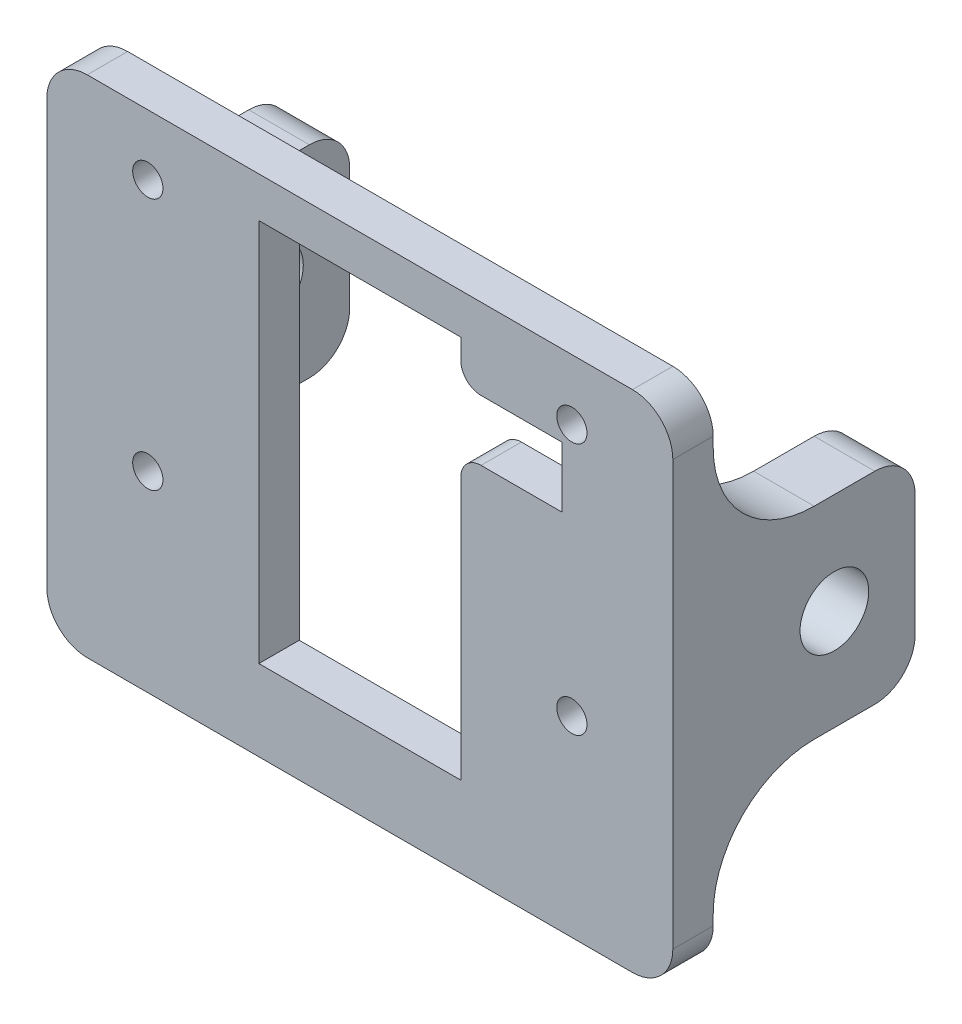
ISO-10303-21;
HEADER;
FILE_DESCRIPTION(('STEP AP214'),'2;1');
FILE_NAME('part.step','',(''),(''),'','','');
FILE_SCHEMA(('AUTOMOTIVE_DESIGN { 1 0 10303 214 1 1 1 1 }'));
ENDSEC;
DATA;
#1=APPLICATION_CONTEXT('core data for automotive mechanical design processes');
#2=APPLICATION_PROTOCOL_DEFINITION('international standard','automotive_design',2000,#1);
#3=PRODUCT_CONTEXT('',#1,'mechanical');
#4=PRODUCT('Part','Part','',(#3));
#5=PRODUCT_RELATED_PRODUCT_CATEGORY('part','',(#4));
#6=PRODUCT_DEFINITION_FORMATION('','',#4);
#7=PRODUCT_DEFINITION_CONTEXT('part definition',#1,'design');
#8=PRODUCT_DEFINITION('design','',#6,#7);
#9=PRODUCT_DEFINITION_SHAPE('','',#8);
#10=(LENGTH_UNIT() NAMED_UNIT(*) SI_UNIT(.MILLI.,.METRE.));
#11=(NAMED_UNIT(*) PLANE_ANGLE_UNIT() SI_UNIT($,.RADIAN.));
#12=(NAMED_UNIT(*) SI_UNIT($,.STERADIAN.) SOLID_ANGLE_UNIT());
#13=UNCERTAINTY_MEASURE_WITH_UNIT(LENGTH_MEASURE(1.E-05),#10,'distance_accuracy_value','');
#14=(GEOMETRIC_REPRESENTATION_CONTEXT(3) GLOBAL_UNCERTAINTY_ASSIGNED_CONTEXT((#13)) GLOBAL_UNIT_ASSIGNED_CONTEXT((#10,
#11,#12)) REPRESENTATION_CONTEXT('',''));
#15=CARTESIAN_POINT('',(0.,0.,0.));
#16=DIRECTION('',(0.,0.,1.));
#17=DIRECTION('',(1.,0.,0.));
#18=AXIS2_PLACEMENT_3D('',#15,#16,#17);
#19=CARTESIAN_POINT('',(0.,0.,0.));
#20=DIRECTION('',(0.,0.,1.));
#21=DIRECTION('',(1.,0.,0.));
#22=AXIS2_PLACEMENT_3D('',#19,#20,#21);
#23=PLANE('',#22);
#24=DIRECTION('',(1.,0.,0.));
#25=VECTOR('',#24,1.);
#26=CARTESIAN_POINT('',(4.99999999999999,8.5,0.));
#27=LINE('',#26,#25);
#28=CARTESIAN_POINT('',(6.,8.5,0.));
#29=VERTEX_POINT('',#28);
#30=CARTESIAN_POINT('',(10.,8.5,0.));
#31=VERTEX_POINT('',#30);
#32=EDGE_CURVE('E262',#29,#31,#27,.T.);
#33=ORIENTED_EDGE('',*,*,#32,.F.);
#34=CARTESIAN_POINT('',(6.,9.50000000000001,0.));
#35=DIRECTION('',(0.,0.,1.));
#36=DIRECTION('',(1.,0.,0.));
#37=AXIS2_PLACEMENT_3D('',#34,#35,#36);
#38=CIRCLE('',#37,1.);
#39=CARTESIAN_POINT('',(5.,9.50000000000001,0.));
#40=VERTEX_POINT('',#39);
#41=EDGE_CURVE('E500',#29,#40,#38,.F.);
#42=ORIENTED_EDGE('',*,*,#41,.T.);
#43=DIRECTION('',(0.,-1.,0.));
#44=VECTOR('',#43,1.);
#45=CARTESIAN_POINT('',(5.,10.5,0.));
#46=LINE('',#45,#44);
#47=CARTESIAN_POINT('',(5.,10.5,0.));
#48=VERTEX_POINT('',#47);
#49=EDGE_CURVE('E286',#48,#40,#46,.T.);
#50=ORIENTED_EDGE('',*,*,#49,.F.);
#51=DIRECTION('',(1.,0.,0.));
#52=VECTOR('',#51,1.);
#53=CARTESIAN_POINT('',(-5.,10.5,0.));
#54=LINE('',#53,#52);
#55=CARTESIAN_POINT('',(-5.,10.5,0.));
#56=VERTEX_POINT('',#55);
#57=EDGE_CURVE('E289',#56,#48,#54,.T.);
#58=ORIENTED_EDGE('',*,*,#57,.F.);
#59=DIRECTION('',(0.,1.,0.));
#60=VECTOR('',#59,1.);
#61=CARTESIAN_POINT('',(-5.,10.5,0.));
#62=LINE('',#61,#60);
#63=CARTESIAN_POINT('',(-5.,-8.49999999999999,0.));
#64=VERTEX_POINT('',#63);
#65=EDGE_CURVE('E292',#64,#56,#62,.T.);
#66=ORIENTED_EDGE('',*,*,#65,.F.);
#67=DIRECTION('',(-1.,0.,0.));
#68=VECTOR('',#67,1.);
#69=CARTESIAN_POINT('',(-5.,-8.49999999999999,0.));
#70=LINE('',#69,#68);
#71=CARTESIAN_POINT('',(5.,-8.49999999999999,0.));
#72=VERTEX_POINT('',#71);
#73=EDGE_CURVE('E309',#72,#64,#70,.T.);
#74=ORIENTED_EDGE('',*,*,#73,.F.);
#75=CARTESIAN_POINT('',(5.,4.5,0.));
#76=VERTEX_POINT('',#75);
#77=EDGE_CURVE('E285',#76,#72,#46,.T.);
#78=ORIENTED_EDGE('',*,*,#77,.F.);
#79=CARTESIAN_POINT('',(6.,4.5,0.));
#80=DIRECTION('',(0.,0.,1.));
#81=DIRECTION('',(1.,0.,0.));
#82=AXIS2_PLACEMENT_3D('',#79,#80,#81);
#83=CIRCLE('',#82,1.);
#84=CARTESIAN_POINT('',(6.,5.5,0.));
#85=VERTEX_POINT('',#84);
#86=EDGE_CURVE('E47',#76,#85,#83,.F.);
#87=ORIENTED_EDGE('',*,*,#86,.T.);
#88=DIRECTION('',(-1.,0.,0.));
#89=VECTOR('',#88,1.);
#90=CARTESIAN_POINT('',(4.99999999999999,5.5,0.));
#91=LINE('',#90,#89);
#92=CARTESIAN_POINT('',(10.,5.50000000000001,0.));
#93=VERTEX_POINT('',#92);
#94=EDGE_CURVE('E282',#93,#85,#91,.T.);
#95=ORIENTED_EDGE('',*,*,#94,.F.);
#96=DIRECTION('',(0.,-1.,0.));
#97=VECTOR('',#96,1.);
#98=CARTESIAN_POINT('',(10.,8.5,0.));
#99=LINE('',#98,#97);
#100=EDGE_CURVE('E270',#31,#93,#99,.T.);
#101=ORIENTED_EDGE('',*,*,#100,.F.);
#102=EDGE_LOOP('',(#33,#42,#50,#58,#66,#74,#78,#87,#95,#101));
#103=FACE_BOUND('',#102,.T.);
#104=CARTESIAN_POINT('',(-10.5,-3.,0.));
#105=DIRECTION('',(0.,0.,1.));
#106=DIRECTION('',(1.,0.,0.));
#107=AXIS2_PLACEMENT_3D('',#104,#105,#106);
#108=CIRCLE('',#107,0.75);
#109=CARTESIAN_POINT('',(-9.75,-3.,0.));
#110=VERTEX_POINT('',#109);
#111=EDGE_CURVE('E323',#110,#110,#108,.F.);
#112=ORIENTED_EDGE('',*,*,#111,.F.);
#113=EDGE_LOOP('',(#112));
#114=FACE_BOUND('',#113,.T.);
#115=CARTESIAN_POINT('',(10.5,-3.,0.));
#116=DIRECTION('',(0.,0.,1.));
#117=DIRECTION('',(1.,0.,0.));
#118=AXIS2_PLACEMENT_3D('',#115,#116,#117);
#119=CIRCLE('',#118,0.75);
#120=CARTESIAN_POINT('',(11.25,-3.,0.));
#121=VERTEX_POINT('',#120);
#122=EDGE_CURVE('E324',#121,#121,#119,.F.);
#123=ORIENTED_EDGE('',*,*,#122,.F.);
#124=EDGE_LOOP('',(#123));
#125=FACE_BOUND('',#124,.T.);
#126=CARTESIAN_POINT('',(10.5,9.50000000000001,0.));
#127=DIRECTION('',(0.,0.,1.));
#128=DIRECTION('',(1.,0.,0.));
#129=AXIS2_PLACEMENT_3D('',#126,#127,#128);
#130=CIRCLE('',#129,0.75);
#131=CARTESIAN_POINT('',(11.25,9.50000000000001,0.));
#132=VERTEX_POINT('',#131);
#133=EDGE_CURVE('E331',#132,#132,#130,.F.);
#134=ORIENTED_EDGE('',*,*,#133,.F.);
#135=EDGE_LOOP('',(#134));
#136=FACE_BOUND('',#135,.T.);
#137=CARTESIAN_POINT('',(-10.5,9.50000000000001,0.));
#138=DIRECTION('',(0.,0.,1.));
#139=DIRECTION('',(1.,0.,0.));
#140=AXIS2_PLACEMENT_3D('',#137,#138,#139);
#141=CIRCLE('',#140,0.75);
#142=CARTESIAN_POINT('',(-9.75,9.50000000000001,0.));
#143=VERTEX_POINT('',#142);
#144=EDGE_CURVE('E340',#143,#143,#141,.F.);
#145=ORIENTED_EDGE('',*,*,#144,.F.);
#146=EDGE_LOOP('',(#145));
#147=FACE_BOUND('',#146,.T.);
#148=DIRECTION('',(0.,1.,0.));
#149=VECTOR('',#148,1.);
#150=CARTESIAN_POINT('',(15.5,12.5,0.));
#151=LINE('',#150,#149);
#152=CARTESIAN_POINT('',(15.5,-10.5,0.));
#153=VERTEX_POINT('',#152);
#154=CARTESIAN_POINT('',(15.5,-10.,0.));
#155=VERTEX_POINT('',#154);
#156=EDGE_CURVE('E364',#153,#155,#151,.T.);
#157=ORIENTED_EDGE('',*,*,#156,.F.);
#158=CARTESIAN_POINT('',(13.5,-10.5,0.));
#159=DIRECTION('',(0.,0.,1.));
#160=DIRECTION('',(1.,0.,0.));
#161=AXIS2_PLACEMENT_3D('',#158,#159,#160);
#162=CIRCLE('',#161,2.);
#163=CARTESIAN_POINT('',(13.5,-12.5,0.));
#164=VERTEX_POINT('',#163);
#165=EDGE_CURVE('E465',#153,#164,#162,.F.);
#166=ORIENTED_EDGE('',*,*,#165,.T.);
#167=DIRECTION('',(1.,0.,0.));
#168=VECTOR('',#167,1.);
#169=CARTESIAN_POINT('',(-15.5,-12.5,0.));
#170=LINE('',#169,#168);
#171=CARTESIAN_POINT('',(-13.5,-12.5,0.));
#172=VERTEX_POINT('',#171);
#173=EDGE_CURVE('E360',#172,#164,#170,.T.);
#174=ORIENTED_EDGE('',*,*,#173,.F.);
#175=CARTESIAN_POINT('',(-13.5,-10.5,0.));
#176=DIRECTION('',(0.,0.,1.));
#177=DIRECTION('',(1.,0.,0.));
#178=AXIS2_PLACEMENT_3D('',#175,#176,#177);
#179=CIRCLE('',#178,2.);
#180=CARTESIAN_POINT('',(-15.5,-10.5,0.));
#181=VERTEX_POINT('',#180);
#182=EDGE_CURVE('E463',#172,#181,#179,.F.);
#183=ORIENTED_EDGE('',*,*,#182,.T.);
#184=DIRECTION('',(0.,-1.,0.));
#185=VECTOR('',#184,1.);
#186=CARTESIAN_POINT('',(-15.5,12.5,0.));
#187=LINE('',#186,#185);
#188=CARTESIAN_POINT('',(-15.5,-9.99999999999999,0.));
#189=VERTEX_POINT('',#188);
#190=EDGE_CURVE('E343',#189,#181,#187,.T.);
#191=ORIENTED_EDGE('',*,*,#190,.F.);
#192=DIRECTION('',(-1.,0.,0.));
#193=VECTOR('',#192,1.);
#194=CARTESIAN_POINT('',(-12.5,-9.99999999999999,0.));
#195=LINE('',#194,#193);
#196=CARTESIAN_POINT('',(-12.5,-9.99999999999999,0.));
#197=VERTEX_POINT('',#196);
#198=EDGE_CURVE('E373',#189,#197,#195,.F.);
#199=ORIENTED_EDGE('',*,*,#198,.T.);
#200=DIRECTION('',(0.,-1.,0.));
#201=VECTOR('',#200,1.);
#202=CARTESIAN_POINT('',(-12.5,5.,0.));
#203=LINE('',#202,#201);
#204=CARTESIAN_POINT('',(-12.5,10.,0.));
#205=VERTEX_POINT('',#204);
#206=EDGE_CURVE('E526',#205,#197,#203,.T.);
#207=ORIENTED_EDGE('',*,*,#206,.F.);
#208=DIRECTION('',(1.,0.,0.));
#209=VECTOR('',#208,1.);
#210=CARTESIAN_POINT('',(-15.5,10.,0.));
#211=LINE('',#210,#209);
#212=CARTESIAN_POINT('',(-15.5,10.,0.));
#213=VERTEX_POINT('',#212);
#214=EDGE_CURVE('E376',#205,#213,#211,.F.);
#215=ORIENTED_EDGE('',*,*,#214,.T.);
#216=CARTESIAN_POINT('',(-15.5,10.5,0.));
#217=VERTEX_POINT('',#216);
#218=EDGE_CURVE('E358',#217,#213,#187,.T.);
#219=ORIENTED_EDGE('',*,*,#218,.F.);
#220=CARTESIAN_POINT('',(-13.5,10.5,0.));
#221=DIRECTION('',(0.,0.,1.));
#222=DIRECTION('',(1.,0.,0.));
#223=AXIS2_PLACEMENT_3D('',#220,#221,#222);
#224=CIRCLE('',#223,2.);
#225=CARTESIAN_POINT('',(-13.5,12.5,0.));
#226=VERTEX_POINT('',#225);
#227=EDGE_CURVE('E459',#217,#226,#224,.F.);
#228=ORIENTED_EDGE('',*,*,#227,.T.);
#229=DIRECTION('',(-1.,0.,0.));
#230=VECTOR('',#229,1.);
#231=CARTESIAN_POINT('',(-15.5,12.5,0.));
#232=LINE('',#231,#230);
#233=CARTESIAN_POINT('',(13.5,12.5,0.));
#234=VERTEX_POINT('',#233);
#235=EDGE_CURVE('E348',#234,#226,#232,.T.);
#236=ORIENTED_EDGE('',*,*,#235,.F.);
#237=CARTESIAN_POINT('',(13.5,10.5,0.));
#238=DIRECTION('',(0.,0.,1.));
#239=DIRECTION('',(1.,0.,0.));
#240=AXIS2_PLACEMENT_3D('',#237,#238,#239);
#241=CIRCLE('',#240,2.);
#242=CARTESIAN_POINT('',(15.5,10.5,0.));
#243=VERTEX_POINT('',#242);
#244=EDGE_CURVE('E461',#234,#243,#241,.F.);
#245=ORIENTED_EDGE('',*,*,#244,.T.);
#246=CARTESIAN_POINT('',(15.5,10.,0.));
#247=VERTEX_POINT('',#246);
#248=EDGE_CURVE('E363',#247,#243,#151,.T.);
#249=ORIENTED_EDGE('',*,*,#248,.F.);
#250=DIRECTION('',(1.,0.,0.));
#251=VECTOR('',#250,1.);
#252=CARTESIAN_POINT('',(12.5,10.,0.));
#253=LINE('',#252,#251);
#254=CARTESIAN_POINT('',(12.5,10.,0.));
#255=VERTEX_POINT('',#254);
#256=EDGE_CURVE('E379',#247,#255,#253,.F.);
#257=ORIENTED_EDGE('',*,*,#256,.T.);
#258=DIRECTION('',(0.,1.,0.));
#259=VECTOR('',#258,1.);
#260=CARTESIAN_POINT('',(12.5,5.,0.));
#261=LINE('',#260,#259);
#262=CARTESIAN_POINT('',(12.5,-10.,0.));
#263=VERTEX_POINT('',#262);
#264=EDGE_CURVE('E542',#263,#255,#261,.T.);
#265=ORIENTED_EDGE('',*,*,#264,.F.);
#266=DIRECTION('',(-1.,0.,0.));
#267=VECTOR('',#266,1.);
#268=CARTESIAN_POINT('',(15.5,-10.,0.));
#269=LINE('',#268,#267);
#270=EDGE_CURVE('E370',#263,#155,#269,.F.);
#271=ORIENTED_EDGE('',*,*,#270,.T.);
#272=EDGE_LOOP('',(#157,#166,#174,#183,#191,#199,#207,#215,#219,#228,#236,#245,#249,#257,#265,#271));
#273=FACE_BOUND('',#272,.T.);
#274=ADVANCED_FACE('F32',(#103,#114,#125,#136,#147,#273),#23,.F.);
#275=CARTESIAN_POINT('',(5.,10.5,-0.00100000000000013));
#276=DIRECTION('',(1.,0.,0.));
#277=DIRECTION('',(0.,1.,0.));
#278=AXIS2_PLACEMENT_3D('',#275,#276,#277);
#279=PLANE('',#278);
#280=ORIENTED_EDGE('',*,*,#49,.T.);
#281=DIRECTION('',(0.,0.,1.));
#282=VECTOR('',#281,1.);
#283=CARTESIAN_POINT('',(5.,9.50000000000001,-0.00100000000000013));
#284=LINE('',#283,#282);
#285=CARTESIAN_POINT('',(5.,9.50000000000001,2.));
#286=VERTEX_POINT('',#285);
#287=EDGE_CURVE('E490',#40,#286,#284,.T.);
#288=ORIENTED_EDGE('',*,*,#287,.T.);
#289=DIRECTION('',(0.,1.,0.));
#290=VECTOR('',#289,1.);
#291=CARTESIAN_POINT('',(5.,10.5,2.));
#292=LINE('',#291,#290);
#293=CARTESIAN_POINT('',(5.,10.5,2.));
#294=VERTEX_POINT('',#293);
#295=EDGE_CURVE('E300',#286,#294,#292,.T.);
#296=ORIENTED_EDGE('',*,*,#295,.T.);
#297=DIRECTION('',(0.,0.,1.));
#298=VECTOR('',#297,1.);
#299=CARTESIAN_POINT('',(5.,10.5,-0.00100000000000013));
#300=LINE('',#299,#298);
#301=EDGE_CURVE('E310',#48,#294,#300,.T.);
#302=ORIENTED_EDGE('',*,*,#301,.F.);
#303=EDGE_LOOP('',(#280,#288,#296,#302));
#304=FACE_BOUND('',#303,.T.);
#305=ADVANCED_FACE('F510',(#304),#279,.F.);
#306=CARTESIAN_POINT('',(-15.5,12.5,2.));
#307=DIRECTION('',(1.,0.,0.));
#308=DIRECTION('',(0.,1.,0.));
#309=AXIS2_PLACEMENT_3D('',#306,#307,#308);
#310=PLANE('',#309);
#311=CARTESIAN_POINT('',(-15.5,0.,-6.));
#312=DIRECTION('',(1.,0.,0.));
#313=DIRECTION('',(0.,1.,0.));
#314=AXIS2_PLACEMENT_3D('',#311,#312,#313);
#315=CIRCLE('',#314,1.7);
#316=CARTESIAN_POINT('',(-15.5,1.69999999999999,-6.));
#317=VERTEX_POINT('',#316);
#318=EDGE_CURVE('E454',#317,#317,#315,.T.);
#319=ORIENTED_EDGE('',*,*,#318,.T.);
#320=EDGE_LOOP('',(#319));
#321=FACE_BOUND('',#320,.T.);
#322=ORIENTED_EDGE('',*,*,#190,.T.);
#323=DIRECTION('',(0.,0.,-1.));
#324=VECTOR('',#323,1.);
#325=CARTESIAN_POINT('',(-15.5,-10.5,2.));
#326=LINE('',#325,#324);
#327=CARTESIAN_POINT('',(-15.5,-10.5,2.));
#328=VERTEX_POINT('',#327);
#329=EDGE_CURVE('E483',#181,#328,#326,.F.);
#330=ORIENTED_EDGE('',*,*,#329,.T.);
#331=DIRECTION('',(0.,-1.,0.));
#332=VECTOR('',#331,1.);
#333=CARTESIAN_POINT('',(-15.5,12.5,2.));
#334=LINE('',#333,#332);
#335=CARTESIAN_POINT('',(-15.5,10.5,2.));
#336=VERTEX_POINT('',#335);
#337=EDGE_CURVE('E344',#336,#328,#334,.T.);
#338=ORIENTED_EDGE('',*,*,#337,.F.);
#339=DIRECTION('',(0.,0.,-1.));
#340=VECTOR('',#339,1.);
#341=CARTESIAN_POINT('',(-15.5,10.5,2.));
#342=LINE('',#341,#340);
#343=EDGE_CURVE('E480',#336,#217,#342,.T.);
#344=ORIENTED_EDGE('',*,*,#343,.T.);
#345=ORIENTED_EDGE('',*,*,#218,.T.);
#346=CARTESIAN_POINT('',(-15.5,10.,-5.));
#347=DIRECTION('',(1.,0.,0.));
#348=DIRECTION('',(0.,1.,0.));
#349=AXIS2_PLACEMENT_3D('',#346,#347,#348);
#350=CIRCLE('',#349,5.);
#351=CARTESIAN_POINT('',(-15.5,5.,-5.));
#352=VERTEX_POINT('',#351);
#353=EDGE_CURVE('E399',#213,#352,#350,.T.);
#354=ORIENTED_EDGE('',*,*,#353,.T.);
#355=DIRECTION('',(0.,0.,1.));
#356=VECTOR('',#355,1.);
#357=CARTESIAN_POINT('',(-15.5,5.,-10.));
#358=LINE('',#357,#356);
#359=CARTESIAN_POINT('',(-15.5,5.,-8.));
#360=VERTEX_POINT('',#359);
#361=EDGE_CURVE('E515',#360,#352,#358,.T.);
#362=ORIENTED_EDGE('',*,*,#361,.F.);
#363=CARTESIAN_POINT('',(-15.5,3.,-8.));
#364=DIRECTION('',(1.,0.,0.));
#365=DIRECTION('',(0.,1.,0.));
#366=AXIS2_PLACEMENT_3D('',#363,#364,#365);
#367=CIRCLE('',#366,2.);
#368=CARTESIAN_POINT('',(-15.5,3.,-10.));
#369=VERTEX_POINT('',#368);
#370=EDGE_CURVE('E435',#360,#369,#367,.F.);
#371=ORIENTED_EDGE('',*,*,#370,.T.);
#372=DIRECTION('',(0.,1.,0.));
#373=VECTOR('',#372,1.);
#374=CARTESIAN_POINT('',(-15.5,5.,-10.));
#375=LINE('',#374,#373);
#376=CARTESIAN_POINT('',(-15.5,-3.,-10.));
#377=VERTEX_POINT('',#376);
#378=EDGE_CURVE('E528',#377,#369,#375,.T.);
#379=ORIENTED_EDGE('',*,*,#378,.F.);
#380=CARTESIAN_POINT('',(-15.5,-3.,-8.));
#381=DIRECTION('',(1.,0.,0.));
#382=DIRECTION('',(0.,1.,0.));
#383=AXIS2_PLACEMENT_3D('',#380,#381,#382);
#384=CIRCLE('',#383,2.);
#385=CARTESIAN_POINT('',(-15.5,-5.,-8.));
#386=VERTEX_POINT('',#385);
#387=EDGE_CURVE('E437',#377,#386,#384,.F.);
#388=ORIENTED_EDGE('',*,*,#387,.T.);
#389=DIRECTION('',(0.,0.,1.));
#390=VECTOR('',#389,1.);
#391=CARTESIAN_POINT('',(-15.5,-5.,-10.));
#392=LINE('',#391,#390);
#393=CARTESIAN_POINT('',(-15.5,-5.,-5.));
#394=VERTEX_POINT('',#393);
#395=EDGE_CURVE('E523',#386,#394,#392,.T.);
#396=ORIENTED_EDGE('',*,*,#395,.T.);
#397=CARTESIAN_POINT('',(-15.5,-9.99999999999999,-5.));
#398=DIRECTION('',(1.,0.,0.));
#399=DIRECTION('',(0.,1.,0.));
#400=AXIS2_PLACEMENT_3D('',#397,#398,#399);
#401=CIRCLE('',#400,5.);
#402=EDGE_CURVE('E402',#394,#189,#401,.T.);
#403=ORIENTED_EDGE('',*,*,#402,.T.);
#404=EDGE_LOOP('',(#322,#330,#338,#344,#345,#354,#362,#371,#379,#388,#396,#403));
#405=FACE_BOUND('',#404,.T.);
#406=ADVANCED_FACE('F557',(#321,#405),#310,.F.);
#407=CARTESIAN_POINT('',(-15.5,-12.5,2.));
#408=DIRECTION('',(0.,1.,0.));
#409=DIRECTION('',(-1.,0.,0.));
#410=AXIS2_PLACEMENT_3D('',#407,#408,#409);
#411=PLANE('',#410);
#412=ORIENTED_EDGE('',*,*,#173,.T.);
#413=DIRECTION('',(0.,0.,-1.));
#414=VECTOR('',#413,1.);
#415=CARTESIAN_POINT('',(13.5,-12.5,2.));
#416=LINE('',#415,#414);
#417=CARTESIAN_POINT('',(13.5,-12.5,2.));
#418=VERTEX_POINT('',#417);
#419=EDGE_CURVE('E470',#164,#418,#416,.F.);
#420=ORIENTED_EDGE('',*,*,#419,.T.);
#421=DIRECTION('',(1.,0.,0.));
#422=VECTOR('',#421,1.);
#423=CARTESIAN_POINT('',(-15.5,-12.5,2.));
#424=LINE('',#423,#422);
#425=CARTESIAN_POINT('',(-13.5,-12.5,2.));
#426=VERTEX_POINT('',#425);
#427=EDGE_CURVE('E347',#426,#418,#424,.T.);
#428=ORIENTED_EDGE('',*,*,#427,.F.);
#429=DIRECTION('',(0.,0.,-1.));
#430=VECTOR('',#429,1.);
#431=CARTESIAN_POINT('',(-13.5,-12.5,2.));
#432=LINE('',#431,#430);
#433=EDGE_CURVE('E467',#426,#172,#432,.T.);
#434=ORIENTED_EDGE('',*,*,#433,.T.);
#435=EDGE_LOOP('',(#412,#420,#428,#434));
#436=FACE_BOUND('',#435,.T.);
#437=ADVANCED_FACE('F620',(#436),#411,.F.);
#438=CARTESIAN_POINT('',(15.5,12.5,2.));
#439=DIRECTION('',(-1.,0.,0.));
#440=DIRECTION('',(0.,-1.,0.));
#441=AXIS2_PLACEMENT_3D('',#438,#439,#440);
#442=PLANE('',#441);
#443=CARTESIAN_POINT('',(15.5,0.,-6.));
#444=DIRECTION('',(1.,0.,0.));
#445=DIRECTION('',(0.,1.,0.));
#446=AXIS2_PLACEMENT_3D('',#443,#444,#445);
#447=CIRCLE('',#446,1.7);
#448=CARTESIAN_POINT('',(15.5,1.70000000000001,-6.));
#449=VERTEX_POINT('',#448);
#450=EDGE_CURVE('E551',#449,#449,#447,.T.);
#451=ORIENTED_EDGE('',*,*,#450,.F.);
#452=EDGE_LOOP('',(#451));
#453=FACE_BOUND('',#452,.T.);
#454=DIRECTION('',(0.,1.,0.));
#455=VECTOR('',#454,1.);
#456=CARTESIAN_POINT('',(15.5,12.5,2.));
#457=LINE('',#456,#455);
#458=CARTESIAN_POINT('',(15.5,-10.5,2.));
#459=VERTEX_POINT('',#458);
#460=CARTESIAN_POINT('',(15.5,10.5,2.));
#461=VERTEX_POINT('',#460);
#462=EDGE_CURVE('E351',#459,#461,#457,.T.);
#463=ORIENTED_EDGE('',*,*,#462,.F.);
#464=DIRECTION('',(0.,0.,-1.));
#465=VECTOR('',#464,1.);
#466=CARTESIAN_POINT('',(15.5,-10.5,2.));
#467=LINE('',#466,#465);
#468=EDGE_CURVE('E456',#459,#153,#467,.T.);
#469=ORIENTED_EDGE('',*,*,#468,.T.);
#470=ORIENTED_EDGE('',*,*,#156,.T.);
#471=CARTESIAN_POINT('',(15.5,-10.,-5.));
#472=DIRECTION('',(-1.,0.,0.));
#473=DIRECTION('',(0.,-1.,0.));
#474=AXIS2_PLACEMENT_3D('',#471,#472,#473);
#475=CIRCLE('',#474,5.);
#476=CARTESIAN_POINT('',(15.5,-5.,-5.));
#477=VERTEX_POINT('',#476);
#478=EDGE_CURVE('E410',#155,#477,#475,.T.);
#479=ORIENTED_EDGE('',*,*,#478,.T.);
#480=DIRECTION('',(0.,0.,1.));
#481=VECTOR('',#480,1.);
#482=CARTESIAN_POINT('',(15.5,-5.,-10.));
#483=LINE('',#482,#481);
#484=CARTESIAN_POINT('',(15.5,-5.,-8.));
#485=VERTEX_POINT('',#484);
#486=EDGE_CURVE('E529',#485,#477,#483,.T.);
#487=ORIENTED_EDGE('',*,*,#486,.F.);
#488=CARTESIAN_POINT('',(15.5,-3.,-8.));
#489=DIRECTION('',(-1.,0.,0.));
#490=DIRECTION('',(0.,-1.,0.));
#491=AXIS2_PLACEMENT_3D('',#488,#489,#490);
#492=CIRCLE('',#491,2.);
#493=CARTESIAN_POINT('',(15.5,-3.,-10.));
#494=VERTEX_POINT('',#493);
#495=EDGE_CURVE('E427',#485,#494,#492,.F.);
#496=ORIENTED_EDGE('',*,*,#495,.T.);
#497=DIRECTION('',(0.,-1.,0.));
#498=VECTOR('',#497,1.);
#499=CARTESIAN_POINT('',(15.5,5.,-10.));
#500=LINE('',#499,#498);
#501=CARTESIAN_POINT('',(15.5,3.00000000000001,-10.));
#502=VERTEX_POINT('',#501);
#503=EDGE_CURVE('E544',#502,#494,#500,.T.);
#504=ORIENTED_EDGE('',*,*,#503,.F.);
#505=CARTESIAN_POINT('',(15.5,3.,-8.));
#506=DIRECTION('',(-1.,0.,0.));
#507=DIRECTION('',(0.,-1.,0.));
#508=AXIS2_PLACEMENT_3D('',#505,#506,#507);
#509=CIRCLE('',#508,2.);
#510=CARTESIAN_POINT('',(15.5,5.,-8.));
#511=VERTEX_POINT('',#510);
#512=EDGE_CURVE('E425',#502,#511,#509,.F.);
#513=ORIENTED_EDGE('',*,*,#512,.T.);
#514=DIRECTION('',(0.,0.,1.));
#515=VECTOR('',#514,1.);
#516=CARTESIAN_POINT('',(15.5,5.,-10.));
#517=LINE('',#516,#515);
#518=CARTESIAN_POINT('',(15.5,5.,-5.));
#519=VERTEX_POINT('',#518);
#520=EDGE_CURVE('E539',#511,#519,#517,.T.);
#521=ORIENTED_EDGE('',*,*,#520,.T.);
#522=CARTESIAN_POINT('',(15.5,10.,-5.));
#523=DIRECTION('',(-1.,0.,0.));
#524=DIRECTION('',(0.,-1.,0.));
#525=AXIS2_PLACEMENT_3D('',#522,#523,#524);
#526=CIRCLE('',#525,5.);
#527=EDGE_CURVE('E391',#519,#247,#526,.T.);
#528=ORIENTED_EDGE('',*,*,#527,.T.);
#529=ORIENTED_EDGE('',*,*,#248,.T.);
#530=DIRECTION('',(0.,0.,-1.));
#531=VECTOR('',#530,1.);
#532=CARTESIAN_POINT('',(15.5,10.5,2.));
#533=LINE('',#532,#531);
#534=EDGE_CURVE('E449',#243,#461,#533,.F.);
#535=ORIENTED_EDGE('',*,*,#534,.T.);
#536=EDGE_LOOP('',(#463,#469,#470,#479,#487,#496,#504,#513,#521,#528,#529,#535));
#537=FACE_BOUND('',#536,.T.);
#538=ADVANCED_FACE('F628',(#453,#537),#442,.F.);
#539=CARTESIAN_POINT('',(-15.5,12.5,2.));
#540=DIRECTION('',(0.,-1.,0.));
#541=DIRECTION('',(1.,0.,0.));
#542=AXIS2_PLACEMENT_3D('',#539,#540,#541);
#543=PLANE('',#542);
#544=DIRECTION('',(-1.,0.,0.));
#545=VECTOR('',#544,1.);
#546=CARTESIAN_POINT('',(-15.5,12.5,2.));
#547=LINE('',#546,#545);
#548=CARTESIAN_POINT('',(13.5,12.5,2.));
#549=VERTEX_POINT('',#548);
#550=CARTESIAN_POINT('',(-13.5,12.5,2.));
#551=VERTEX_POINT('',#550);
#552=EDGE_CURVE('E354',#549,#551,#547,.T.);
#553=ORIENTED_EDGE('',*,*,#552,.F.);
#554=DIRECTION('',(0.,0.,-1.));
#555=VECTOR('',#554,1.);
#556=CARTESIAN_POINT('',(13.5,12.5,2.));
#557=LINE('',#556,#555);
#558=EDGE_CURVE('E487',#549,#234,#557,.T.);
#559=ORIENTED_EDGE('',*,*,#558,.T.);
#560=ORIENTED_EDGE('',*,*,#235,.T.);
#561=DIRECTION('',(0.,0.,-1.));
#562=VECTOR('',#561,1.);
#563=CARTESIAN_POINT('',(-13.5,12.5,2.));
#564=LINE('',#563,#562);
#565=EDGE_CURVE('E485',#226,#551,#564,.F.);
#566=ORIENTED_EDGE('',*,*,#565,.T.);
#567=EDGE_LOOP('',(#553,#559,#560,#566));
#568=FACE_BOUND('',#567,.T.);
#569=ADVANCED_FACE('F638',(#568),#543,.F.);
#570=CARTESIAN_POINT('',(0.,0.,2.));
#571=DIRECTION('',(0.,0.,1.));
#572=DIRECTION('',(1.,0.,0.));
#573=AXIS2_PLACEMENT_3D('',#570,#571,#572);
#574=PLANE('',#573);
#575=ORIENTED_EDGE('',*,*,#295,.F.);
#576=CARTESIAN_POINT('',(6.,9.50000000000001,2.));
#577=DIRECTION('',(0.,0.,1.));
#578=DIRECTION('',(1.,0.,0.));
#579=AXIS2_PLACEMENT_3D('',#576,#577,#578);
#580=CIRCLE('',#579,1.);
#581=CARTESIAN_POINT('',(6.,8.5,2.));
#582=VERTEX_POINT('',#581);
#583=EDGE_CURVE('E495',#286,#582,#580,.T.);
#584=ORIENTED_EDGE('',*,*,#583,.T.);
#585=DIRECTION('',(-1.,0.,0.));
#586=VECTOR('',#585,1.);
#587=CARTESIAN_POINT('',(4.99999999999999,8.5,2.));
#588=LINE('',#587,#586);
#589=CARTESIAN_POINT('',(10.,8.5,2.));
#590=VERTEX_POINT('',#589);
#591=EDGE_CURVE('E272',#590,#582,#588,.T.);
#592=ORIENTED_EDGE('',*,*,#591,.F.);
#593=DIRECTION('',(0.,1.,0.));
#594=VECTOR('',#593,1.);
#595=CARTESIAN_POINT('',(10.,8.5,2.));
#596=LINE('',#595,#594);
#597=CARTESIAN_POINT('',(10.,5.50000000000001,2.));
#598=VERTEX_POINT('',#597);
#599=EDGE_CURVE('E261',#598,#590,#596,.T.);
#600=ORIENTED_EDGE('',*,*,#599,.F.);
#601=DIRECTION('',(1.,0.,0.));
#602=VECTOR('',#601,1.);
#603=CARTESIAN_POINT('',(4.99999999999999,5.5,2.));
#604=LINE('',#603,#602);
#605=CARTESIAN_POINT('',(6.,5.5,2.));
#606=VERTEX_POINT('',#605);
#607=EDGE_CURVE('E253',#606,#598,#604,.T.);
#608=ORIENTED_EDGE('',*,*,#607,.F.);
#609=CARTESIAN_POINT('',(6.,4.5,2.));
#610=DIRECTION('',(0.,0.,1.));
#611=DIRECTION('',(1.,0.,0.));
#612=AXIS2_PLACEMENT_3D('',#609,#610,#611);
#613=CIRCLE('',#612,1.);
#614=CARTESIAN_POINT('',(5.,4.5,2.));
#615=VERTEX_POINT('',#614);
#616=EDGE_CURVE('E493',#606,#615,#613,.T.);
#617=ORIENTED_EDGE('',*,*,#616,.T.);
#618=CARTESIAN_POINT('',(5.,-8.49999999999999,2.));
#619=VERTEX_POINT('',#618);
#620=EDGE_CURVE('E301',#619,#615,#292,.T.);
#621=ORIENTED_EDGE('',*,*,#620,.F.);
#622=DIRECTION('',(1.,0.,0.));
#623=VECTOR('',#622,1.);
#624=CARTESIAN_POINT('',(-5.,-8.49999999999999,2.));
#625=LINE('',#624,#623);
#626=CARTESIAN_POINT('',(-5.,-8.49999999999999,2.));
#627=VERTEX_POINT('',#626);
#628=EDGE_CURVE('E297',#627,#619,#625,.T.);
#629=ORIENTED_EDGE('',*,*,#628,.F.);
#630=DIRECTION('',(0.,-1.,0.));
#631=VECTOR('',#630,1.);
#632=CARTESIAN_POINT('',(-5.,10.5,2.));
#633=LINE('',#632,#631);
#634=CARTESIAN_POINT('',(-5.,10.5,2.));
#635=VERTEX_POINT('',#634);
#636=EDGE_CURVE('E295',#635,#627,#633,.T.);
#637=ORIENTED_EDGE('',*,*,#636,.F.);
#638=DIRECTION('',(-1.,0.,0.));
#639=VECTOR('',#638,1.);
#640=CARTESIAN_POINT('',(-5.,10.5,2.));
#641=LINE('',#640,#639);
#642=EDGE_CURVE('E303',#294,#635,#641,.T.);
#643=ORIENTED_EDGE('',*,*,#642,.F.);
#644=EDGE_LOOP('',(#575,#584,#592,#600,#608,#617,#621,#629,#637,#643));
#645=FACE_BOUND('',#644,.T.);
#646=CARTESIAN_POINT('',(-10.5,-3.,2.));
#647=DIRECTION('',(0.,0.,1.));
#648=DIRECTION('',(1.,0.,0.));
#649=AXIS2_PLACEMENT_3D('',#646,#647,#648);
#650=CIRCLE('',#649,0.75);
#651=CARTESIAN_POINT('',(-9.75,-3.,2.));
#652=VERTEX_POINT('',#651);
#653=EDGE_CURVE('E320',#652,#652,#650,.T.);
#654=ORIENTED_EDGE('',*,*,#653,.F.);
#655=EDGE_LOOP('',(#654));
#656=FACE_BOUND('',#655,.T.);
#657=CARTESIAN_POINT('',(10.5,-3.,2.));
#658=DIRECTION('',(0.,0.,1.));
#659=DIRECTION('',(1.,0.,0.));
#660=AXIS2_PLACEMENT_3D('',#657,#658,#659);
#661=CIRCLE('',#660,0.75);
#662=CARTESIAN_POINT('',(11.25,-3.,2.));
#663=VERTEX_POINT('',#662);
#664=EDGE_CURVE('E328',#663,#663,#661,.T.);
#665=ORIENTED_EDGE('',*,*,#664,.F.);
#666=EDGE_LOOP('',(#665));
#667=FACE_BOUND('',#666,.T.);
#668=CARTESIAN_POINT('',(10.5,9.50000000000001,2.));
#669=DIRECTION('',(0.,0.,1.));
#670=DIRECTION('',(1.,0.,0.));
#671=AXIS2_PLACEMENT_3D('',#668,#669,#670);
#672=CIRCLE('',#671,0.75);
#673=CARTESIAN_POINT('',(11.25,9.50000000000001,2.));
#674=VERTEX_POINT('',#673);
#675=EDGE_CURVE('E319',#674,#674,#672,.T.);
#676=ORIENTED_EDGE('',*,*,#675,.F.);
#677=EDGE_LOOP('',(#676));
#678=FACE_BOUND('',#677,.T.);
#679=CARTESIAN_POINT('',(-10.5,9.50000000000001,2.));
#680=DIRECTION('',(0.,0.,1.));
#681=DIRECTION('',(1.,0.,0.));
#682=AXIS2_PLACEMENT_3D('',#679,#680,#681);
#683=CIRCLE('',#682,0.75);
#684=CARTESIAN_POINT('',(-9.75,9.50000000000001,2.));
#685=VERTEX_POINT('',#684);
#686=EDGE_CURVE('E327',#685,#685,#683,.T.);
#687=ORIENTED_EDGE('',*,*,#686,.F.);
#688=EDGE_LOOP('',(#687));
#689=FACE_BOUND('',#688,.T.);
#690=ORIENTED_EDGE('',*,*,#427,.T.);
#691=CARTESIAN_POINT('',(13.5,-10.5,2.));
#692=DIRECTION('',(0.,0.,1.));
#693=DIRECTION('',(1.,0.,0.));
#694=AXIS2_PLACEMENT_3D('',#691,#692,#693);
#695=CIRCLE('',#694,2.);
#696=EDGE_CURVE('E478',#418,#459,#695,.T.);
#697=ORIENTED_EDGE('',*,*,#696,.T.);
#698=ORIENTED_EDGE('',*,*,#462,.T.);
#699=CARTESIAN_POINT('',(13.5,10.5,2.));
#700=DIRECTION('',(0.,0.,1.));
#701=DIRECTION('',(1.,0.,0.));
#702=AXIS2_PLACEMENT_3D('',#699,#700,#701);
#703=CIRCLE('',#702,2.);
#704=EDGE_CURVE('E474',#461,#549,#703,.T.);
#705=ORIENTED_EDGE('',*,*,#704,.T.);
#706=ORIENTED_EDGE('',*,*,#552,.T.);
#707=CARTESIAN_POINT('',(-13.5,10.5,2.));
#708=DIRECTION('',(0.,0.,1.));
#709=DIRECTION('',(1.,0.,0.));
#710=AXIS2_PLACEMENT_3D('',#707,#708,#709);
#711=CIRCLE('',#710,2.);
#712=EDGE_CURVE('E472',#551,#336,#711,.T.);
#713=ORIENTED_EDGE('',*,*,#712,.T.);
#714=ORIENTED_EDGE('',*,*,#337,.T.);
#715=CARTESIAN_POINT('',(-13.5,-10.5,2.));
#716=DIRECTION('',(0.,0.,1.));
#717=DIRECTION('',(1.,0.,0.));
#718=AXIS2_PLACEMENT_3D('',#715,#716,#717);
#719=CIRCLE('',#718,2.);
#720=EDGE_CURVE('E476',#328,#426,#719,.T.);
#721=ORIENTED_EDGE('',*,*,#720,.T.);
#722=EDGE_LOOP('',(#690,#697,#698,#705,#706,#713,#714,#721));
#723=FACE_BOUND('',#722,.T.);
#724=ADVANCED_FACE('F275',(#645,#656,#667,#678,#689,#723),#574,.T.);
#725=CARTESIAN_POINT('',(-10.5,9.50000000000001,-0.00100000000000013));
#726=DIRECTION('',(0.,0.,1.));
#727=DIRECTION('',(1.,0.,0.));
#728=AXIS2_PLACEMENT_3D('',#725,#726,#727);
#729=CYLINDRICAL_SURFACE('',#728,0.75);
#730=ORIENTED_EDGE('',*,*,#686,.T.);
#731=EDGE_LOOP('',(#730));
#732=FACE_BOUND('',#731,.T.);
#733=ORIENTED_EDGE('',*,*,#144,.T.);
#734=EDGE_LOOP('',(#733));
#735=FACE_BOUND('',#734,.T.);
#736=ADVANCED_FACE('F773',(#732,#735),#729,.F.);
#737=CARTESIAN_POINT('',(10.5,9.50000000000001,-0.00100000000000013));
#738=DIRECTION('',(0.,0.,1.));
#739=DIRECTION('',(1.,0.,0.));
#740=AXIS2_PLACEMENT_3D('',#737,#738,#739);
#741=CYLINDRICAL_SURFACE('',#740,0.75);
#742=ORIENTED_EDGE('',*,*,#675,.T.);
#743=EDGE_LOOP('',(#742));
#744=FACE_BOUND('',#743,.T.);
#745=ORIENTED_EDGE('',*,*,#133,.T.);
#746=EDGE_LOOP('',(#745));
#747=FACE_BOUND('',#746,.T.);
#748=ADVANCED_FACE('F770',(#744,#747),#741,.F.);
#749=CARTESIAN_POINT('',(10.5,-3.,-0.00100000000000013));
#750=DIRECTION('',(0.,0.,1.));
#751=DIRECTION('',(1.,0.,0.));
#752=AXIS2_PLACEMENT_3D('',#749,#750,#751);
#753=CYLINDRICAL_SURFACE('',#752,0.75);
#754=ORIENTED_EDGE('',*,*,#664,.T.);
#755=EDGE_LOOP('',(#754));
#756=FACE_BOUND('',#755,.T.);
#757=ORIENTED_EDGE('',*,*,#122,.T.);
#758=EDGE_LOOP('',(#757));
#759=FACE_BOUND('',#758,.T.);
#760=ADVANCED_FACE('F766',(#756,#759),#753,.F.);
#761=CARTESIAN_POINT('',(-10.5,-3.,-0.00100000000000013));
#762=DIRECTION('',(0.,0.,1.));
#763=DIRECTION('',(1.,0.,0.));
#764=AXIS2_PLACEMENT_3D('',#761,#762,#763);
#765=CYLINDRICAL_SURFACE('',#764,0.75);
#766=ORIENTED_EDGE('',*,*,#653,.T.);
#767=EDGE_LOOP('',(#766));
#768=FACE_BOUND('',#767,.T.);
#769=ORIENTED_EDGE('',*,*,#111,.T.);
#770=EDGE_LOOP('',(#769));
#771=FACE_BOUND('',#770,.T.);
#772=ADVANCED_FACE('F757',(#768,#771),#765,.F.);
#773=CARTESIAN_POINT('',(-5.,10.5,-0.00100000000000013));
#774=DIRECTION('',(-1.,0.,0.));
#775=DIRECTION('',(0.,-1.,0.));
#776=AXIS2_PLACEMENT_3D('',#773,#774,#775);
#777=PLANE('',#776);
#778=ORIENTED_EDGE('',*,*,#65,.T.);
#779=DIRECTION('',(0.,0.,1.));
#780=VECTOR('',#779,1.);
#781=CARTESIAN_POINT('',(-5.,10.5,-0.00100000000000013));
#782=LINE('',#781,#780);
#783=EDGE_CURVE('E307',#56,#635,#782,.T.);
#784=ORIENTED_EDGE('',*,*,#783,.T.);
#785=ORIENTED_EDGE('',*,*,#636,.T.);
#786=DIRECTION('',(0.,0.,1.));
#787=VECTOR('',#786,1.);
#788=CARTESIAN_POINT('',(-5.,-8.49999999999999,-0.00100000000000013));
#789=LINE('',#788,#787);
#790=EDGE_CURVE('E306',#64,#627,#789,.T.);
#791=ORIENTED_EDGE('',*,*,#790,.F.);
#792=EDGE_LOOP('',(#778,#784,#785,#791));
#793=FACE_BOUND('',#792,.T.);
#794=ADVANCED_FACE('F747',(#793),#777,.F.);
#795=CARTESIAN_POINT('',(-5.,10.5,-0.00100000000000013));
#796=DIRECTION('',(0.,1.,0.));
#797=DIRECTION('',(0.,0.,1.));
#798=AXIS2_PLACEMENT_3D('',#795,#796,#797);
#799=PLANE('',#798);
#800=ORIENTED_EDGE('',*,*,#57,.T.);
#801=ORIENTED_EDGE('',*,*,#301,.T.);
#802=ORIENTED_EDGE('',*,*,#642,.T.);
#803=ORIENTED_EDGE('',*,*,#783,.F.);
#804=EDGE_LOOP('',(#800,#801,#802,#803));
#805=FACE_BOUND('',#804,.T.);
#806=ADVANCED_FACE('F750',(#805),#799,.F.);
#807=ORIENTED_EDGE('',*,*,#620,.T.);
#808=DIRECTION('',(0.,0.,1.));
#809=VECTOR('',#808,1.);
#810=CARTESIAN_POINT('',(5.,4.5,-0.00100000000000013));
#811=LINE('',#810,#809);
#812=EDGE_CURVE('E11',#615,#76,#811,.F.);
#813=ORIENTED_EDGE('',*,*,#812,.T.);
#814=ORIENTED_EDGE('',*,*,#77,.T.);
#815=DIRECTION('',(0.,0.,1.));
#816=VECTOR('',#815,1.);
#817=CARTESIAN_POINT('',(5.,-8.49999999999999,-0.00100000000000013));
#818=LINE('',#817,#816);
#819=EDGE_CURVE('E313',#72,#619,#818,.T.);
#820=ORIENTED_EDGE('',*,*,#819,.T.);
#821=EDGE_LOOP('',(#807,#813,#814,#820));
#822=FACE_BOUND('',#821,.T.);
#823=ADVANCED_FACE('F696',(#822),#279,.F.);
#824=CARTESIAN_POINT('',(-5.,-8.49999999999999,-0.00100000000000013));
#825=DIRECTION('',(0.,-1.,0.));
#826=DIRECTION('',(0.,0.,-1.));
#827=AXIS2_PLACEMENT_3D('',#824,#825,#826);
#828=PLANE('',#827);
#829=ORIENTED_EDGE('',*,*,#73,.T.);
#830=ORIENTED_EDGE('',*,*,#790,.T.);
#831=ORIENTED_EDGE('',*,*,#628,.T.);
#832=ORIENTED_EDGE('',*,*,#819,.F.);
#833=EDGE_LOOP('',(#829,#830,#831,#832));
#834=FACE_BOUND('',#833,.T.);
#835=ADVANCED_FACE('F744',(#834),#828,.F.);
#836=CARTESIAN_POINT('',(4.99999999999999,8.5,-0.00100000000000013));
#837=DIRECTION('',(0.,1.,0.));
#838=DIRECTION('',(-1.,0.,0.));
#839=AXIS2_PLACEMENT_3D('',#836,#837,#838);
#840=PLANE('',#839);
#841=ORIENTED_EDGE('',*,*,#591,.T.);
#842=DIRECTION('',(0.,0.,1.));
#843=VECTOR('',#842,1.);
#844=CARTESIAN_POINT('',(6.,8.5,-0.00100000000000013));
#845=LINE('',#844,#843);
#846=EDGE_CURVE('E497',#582,#29,#845,.F.);
#847=ORIENTED_EDGE('',*,*,#846,.T.);
#848=ORIENTED_EDGE('',*,*,#32,.T.);
#849=DIRECTION('',(0.,0.,1.));
#850=VECTOR('',#849,1.);
#851=CARTESIAN_POINT('',(10.,8.5,-0.00100000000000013));
#852=LINE('',#851,#850);
#853=EDGE_CURVE('E271',#31,#590,#852,.T.);
#854=ORIENTED_EDGE('',*,*,#853,.T.);
#855=EDGE_LOOP('',(#841,#847,#848,#854));
#856=FACE_BOUND('',#855,.T.);
#857=ADVANCED_FACE('F514',(#856),#840,.F.);
#858=CARTESIAN_POINT('',(10.,8.5,-0.00100000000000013));
#859=DIRECTION('',(1.,0.,0.));
#860=DIRECTION('',(0.,0.,-1.));
#861=AXIS2_PLACEMENT_3D('',#858,#859,#860);
#862=PLANE('',#861);
#863=ORIENTED_EDGE('',*,*,#100,.T.);
#864=DIRECTION('',(0.,0.,1.));
#865=VECTOR('',#864,1.);
#866=CARTESIAN_POINT('',(10.,5.50000000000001,-0.00100000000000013));
#867=LINE('',#866,#865);
#868=EDGE_CURVE('E256',#93,#598,#867,.T.);
#869=ORIENTED_EDGE('',*,*,#868,.T.);
#870=ORIENTED_EDGE('',*,*,#599,.T.);
#871=ORIENTED_EDGE('',*,*,#853,.F.);
#872=EDGE_LOOP('',(#863,#869,#870,#871));
#873=FACE_BOUND('',#872,.T.);
#874=ADVANCED_FACE('F266',(#873),#862,.F.);
#875=CARTESIAN_POINT('',(4.99999999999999,5.5,-0.00100000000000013));
#876=DIRECTION('',(0.,-1.,0.));
#877=DIRECTION('',(1.,0.,0.));
#878=AXIS2_PLACEMENT_3D('',#875,#876,#877);
#879=PLANE('',#878);
#880=ORIENTED_EDGE('',*,*,#94,.T.);
#881=DIRECTION('',(0.,0.,1.));
#882=VECTOR('',#881,1.);
#883=CARTESIAN_POINT('',(6.,5.5,-0.00100000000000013));
#884=LINE('',#883,#882);
#885=EDGE_CURVE('E40',#85,#606,#884,.T.);
#886=ORIENTED_EDGE('',*,*,#885,.T.);
#887=ORIENTED_EDGE('',*,*,#607,.T.);
#888=ORIENTED_EDGE('',*,*,#868,.F.);
#889=EDGE_LOOP('',(#880,#886,#887,#888));
#890=FACE_BOUND('',#889,.T.);
#891=ADVANCED_FACE('F255',(#890),#879,.F.);
#892=CARTESIAN_POINT('',(-15.5,5.,-10.));
#893=DIRECTION('',(0.,-1.,0.));
#894=DIRECTION('',(0.,0.,-1.));
#895=AXIS2_PLACEMENT_3D('',#892,#893,#894);
#896=PLANE('',#895);
#897=DIRECTION('',(0.,0.,1.));
#898=VECTOR('',#897,1.);
#899=CARTESIAN_POINT('',(-12.5,5.,-10.));
#900=LINE('',#899,#898);
#901=CARTESIAN_POINT('',(-12.5,5.,-8.));
#902=VERTEX_POINT('',#901);
#903=CARTESIAN_POINT('',(-12.5,5.,-5.));
#904=VERTEX_POINT('',#903);
#905=EDGE_CURVE('E517',#902,#904,#900,.T.);
#906=ORIENTED_EDGE('',*,*,#905,.F.);
#907=DIRECTION('',(1.,0.,0.));
#908=VECTOR('',#907,1.);
#909=CARTESIAN_POINT('',(-15.5,5.,-8.));
#910=LINE('',#909,#908);
#911=EDGE_CURVE('E445',#902,#360,#910,.F.);
#912=ORIENTED_EDGE('',*,*,#911,.T.);
#913=ORIENTED_EDGE('',*,*,#361,.T.);
#914=DIRECTION('',(1.,0.,0.));
#915=VECTOR('',#914,1.);
#916=CARTESIAN_POINT('',(-12.5,5.,-5.));
#917=LINE('',#916,#915);
#918=EDGE_CURVE('E382',#352,#904,#917,.T.);
#919=ORIENTED_EDGE('',*,*,#918,.T.);
#920=EDGE_LOOP('',(#906,#912,#913,#919));
#921=FACE_BOUND('',#920,.T.);
#922=ADVANCED_FACE('F572',(#921),#896,.F.);
#923=CARTESIAN_POINT('',(-12.5,5.,-10.));
#924=DIRECTION('',(-1.,0.,0.));
#925=DIRECTION('',(0.,-1.,0.));
#926=AXIS2_PLACEMENT_3D('',#923,#924,#925);
#927=PLANE('',#926);
#928=CARTESIAN_POINT('',(-12.5,0.,-6.));
#929=DIRECTION('',(-1.,0.,0.));
#930=DIRECTION('',(0.,-1.,0.));
#931=AXIS2_PLACEMENT_3D('',#928,#929,#930);
#932=CIRCLE('',#931,1.7);
#933=CARTESIAN_POINT('',(-12.5,-1.7,-6.));
#934=VERTEX_POINT('',#933);
#935=EDGE_CURVE('E453',#934,#934,#932,.T.);
#936=ORIENTED_EDGE('',*,*,#935,.T.);
#937=EDGE_LOOP('',(#936));
#938=FACE_BOUND('',#937,.T.);
#939=DIRECTION('',(0.,0.,1.));
#940=VECTOR('',#939,1.);
#941=CARTESIAN_POINT('',(-12.5,-5.,-10.));
#942=LINE('',#941,#940);
#943=CARTESIAN_POINT('',(-12.5,-5.,-8.));
#944=VERTEX_POINT('',#943);
#945=CARTESIAN_POINT('',(-12.5,-5.,-5.));
#946=VERTEX_POINT('',#945);
#947=EDGE_CURVE('E521',#944,#946,#942,.T.);
#948=ORIENTED_EDGE('',*,*,#947,.F.);
#949=CARTESIAN_POINT('',(-12.5,-3.,-8.));
#950=DIRECTION('',(-1.,0.,0.));
#951=DIRECTION('',(0.,-1.,0.));
#952=AXIS2_PLACEMENT_3D('',#949,#950,#951);
#953=CIRCLE('',#952,2.);
#954=CARTESIAN_POINT('',(-12.5,-3.,-10.));
#955=VERTEX_POINT('',#954);
#956=EDGE_CURVE('E443',#944,#955,#953,.F.);
#957=ORIENTED_EDGE('',*,*,#956,.T.);
#958=DIRECTION('',(0.,-1.,0.));
#959=VECTOR('',#958,1.);
#960=CARTESIAN_POINT('',(-12.5,5.,-10.));
#961=LINE('',#960,#959);
#962=CARTESIAN_POINT('',(-12.5,3.,-10.));
#963=VERTEX_POINT('',#962);
#964=EDGE_CURVE('E525',#963,#955,#961,.T.);
#965=ORIENTED_EDGE('',*,*,#964,.F.);
#966=CARTESIAN_POINT('',(-12.5,3.,-8.));
#967=DIRECTION('',(-1.,0.,0.));
#968=DIRECTION('',(0.,-1.,0.));
#969=AXIS2_PLACEMENT_3D('',#966,#967,#968);
#970=CIRCLE('',#969,2.);
#971=EDGE_CURVE('E441',#963,#902,#970,.F.);
#972=ORIENTED_EDGE('',*,*,#971,.T.);
#973=ORIENTED_EDGE('',*,*,#905,.T.);
#974=CARTESIAN_POINT('',(-12.5,10.,-5.));
#975=DIRECTION('',(-1.,0.,0.));
#976=DIRECTION('',(0.,-1.,0.));
#977=AXIS2_PLACEMENT_3D('',#974,#975,#976);
#978=CIRCLE('',#977,5.);
#979=EDGE_CURVE('E396',#904,#205,#978,.T.);
#980=ORIENTED_EDGE('',*,*,#979,.T.);
#981=ORIENTED_EDGE('',*,*,#206,.T.);
#982=CARTESIAN_POINT('',(-12.5,-9.99999999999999,-5.));
#983=DIRECTION('',(-1.,0.,0.));
#984=DIRECTION('',(0.,-1.,0.));
#985=AXIS2_PLACEMENT_3D('',#982,#983,#984);
#986=CIRCLE('',#985,5.);
#987=EDGE_CURVE('E404',#197,#946,#986,.T.);
#988=ORIENTED_EDGE('',*,*,#987,.T.);
#989=EDGE_LOOP('',(#948,#957,#965,#972,#973,#980,#981,#988));
#990=FACE_BOUND('',#989,.T.);
#991=ADVANCED_FACE('F568',(#938,#990),#927,.F.);
#992=CARTESIAN_POINT('',(-15.5,-5.,-10.));
#993=DIRECTION('',(0.,1.,0.));
#994=DIRECTION('',(0.,0.,1.));
#995=AXIS2_PLACEMENT_3D('',#992,#993,#994);
#996=PLANE('',#995);
#997=ORIENTED_EDGE('',*,*,#395,.F.);
#998=DIRECTION('',(-1.,0.,0.));
#999=VECTOR('',#998,1.);
#1000=CARTESIAN_POINT('',(-15.5,-5.,-8.));
#1001=LINE('',#1000,#999);
#1002=EDGE_CURVE('E439',#386,#944,#1001,.F.);
#1003=ORIENTED_EDGE('',*,*,#1002,.T.);
#1004=ORIENTED_EDGE('',*,*,#947,.T.);
#1005=DIRECTION('',(-1.,0.,0.));
#1006=VECTOR('',#1005,1.);
#1007=CARTESIAN_POINT('',(-15.5,-5.,-5.));
#1008=LINE('',#1007,#1006);
#1009=EDGE_CURVE('E385',#946,#394,#1008,.T.);
#1010=ORIENTED_EDGE('',*,*,#1009,.T.);
#1011=EDGE_LOOP('',(#997,#1003,#1004,#1010));
#1012=FACE_BOUND('',#1011,.T.);
#1013=ADVANCED_FACE('F571',(#1012),#996,.F.);
#1014=CARTESIAN_POINT('',(0.,0.,-10.));
#1015=DIRECTION('',(0.,0.,1.));
#1016=DIRECTION('',(1.,0.,0.));
#1017=AXIS2_PLACEMENT_3D('',#1014,#1015,#1016);
#1018=PLANE('',#1017);
#1019=ORIENTED_EDGE('',*,*,#964,.T.);
#1020=DIRECTION('',(-1.,0.,0.));
#1021=VECTOR('',#1020,1.);
#1022=CARTESIAN_POINT('',(0.,-3.,-10.));
#1023=LINE('',#1022,#1021);
#1024=EDGE_CURVE('E432',#955,#377,#1023,.T.);
#1025=ORIENTED_EDGE('',*,*,#1024,.T.);
#1026=ORIENTED_EDGE('',*,*,#378,.T.);
#1027=DIRECTION('',(1.,0.,0.));
#1028=VECTOR('',#1027,1.);
#1029=CARTESIAN_POINT('',(0.,3.,-10.));
#1030=LINE('',#1029,#1028);
#1031=EDGE_CURVE('E429',#369,#963,#1030,.T.);
#1032=ORIENTED_EDGE('',*,*,#1031,.T.);
#1033=EDGE_LOOP('',(#1019,#1025,#1026,#1032));
#1034=FACE_BOUND('',#1033,.T.);
#1035=ADVANCED_FACE('F586',(#1034),#1018,.F.);
#1036=CARTESIAN_POINT('',(15.5,-5.,-10.));
#1037=DIRECTION('',(0.,1.,0.));
#1038=DIRECTION('',(0.,0.,1.));
#1039=AXIS2_PLACEMENT_3D('',#1036,#1037,#1038);
#1040=PLANE('',#1039);
#1041=DIRECTION('',(0.,0.,1.));
#1042=VECTOR('',#1041,1.);
#1043=CARTESIAN_POINT('',(12.5,-5.,-10.));
#1044=LINE('',#1043,#1042);
#1045=CARTESIAN_POINT('',(12.5,-5.,-8.));
#1046=VERTEX_POINT('',#1045);
#1047=CARTESIAN_POINT('',(12.5,-5.,-5.));
#1048=VERTEX_POINT('',#1047);
#1049=EDGE_CURVE('E535',#1046,#1048,#1044,.T.);
#1050=ORIENTED_EDGE('',*,*,#1049,.F.);
#1051=DIRECTION('',(-1.,0.,0.));
#1052=VECTOR('',#1051,1.);
#1053=CARTESIAN_POINT('',(15.5,-5.,-8.));
#1054=LINE('',#1053,#1052);
#1055=EDGE_CURVE('E423',#1046,#485,#1054,.F.);
#1056=ORIENTED_EDGE('',*,*,#1055,.T.);
#1057=ORIENTED_EDGE('',*,*,#486,.T.);
#1058=DIRECTION('',(-1.,0.,0.));
#1059=VECTOR('',#1058,1.);
#1060=CARTESIAN_POINT('',(12.5,-5.,-5.));
#1061=LINE('',#1060,#1059);
#1062=EDGE_CURVE('E388',#477,#1048,#1061,.T.);
#1063=ORIENTED_EDGE('',*,*,#1062,.T.);
#1064=EDGE_LOOP('',(#1050,#1056,#1057,#1063));
#1065=FACE_BOUND('',#1064,.T.);
#1066=ADVANCED_FACE('F687',(#1065),#1040,.F.);
#1067=CARTESIAN_POINT('',(12.5,5.,-10.));
#1068=DIRECTION('',(1.,0.,0.));
#1069=DIRECTION('',(0.,1.,0.));
#1070=AXIS2_PLACEMENT_3D('',#1067,#1068,#1069);
#1071=PLANE('',#1070);
#1072=CARTESIAN_POINT('',(12.5,0.,-6.));
#1073=DIRECTION('',(1.,0.,0.));
#1074=DIRECTION('',(0.,1.,0.));
#1075=AXIS2_PLACEMENT_3D('',#1072,#1073,#1074);
#1076=CIRCLE('',#1075,1.7);
#1077=CARTESIAN_POINT('',(12.5,1.7,-6.));
#1078=VERTEX_POINT('',#1077);
#1079=EDGE_CURVE('E450',#1078,#1078,#1076,.T.);
#1080=ORIENTED_EDGE('',*,*,#1079,.T.);
#1081=EDGE_LOOP('',(#1080));
#1082=FACE_BOUND('',#1081,.T.);
#1083=DIRECTION('',(0.,1.,0.));
#1084=VECTOR('',#1083,1.);
#1085=CARTESIAN_POINT('',(12.5,5.,-10.));
#1086=LINE('',#1085,#1084);
#1087=CARTESIAN_POINT('',(12.5,-3.,-10.));
#1088=VERTEX_POINT('',#1087);
#1089=CARTESIAN_POINT('',(12.5,3.00000000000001,-10.));
#1090=VERTEX_POINT('',#1089);
#1091=EDGE_CURVE('E541',#1088,#1090,#1086,.T.);
#1092=ORIENTED_EDGE('',*,*,#1091,.F.);
#1093=CARTESIAN_POINT('',(12.5,-3.,-8.));
#1094=DIRECTION('',(1.,0.,0.));
#1095=DIRECTION('',(0.,1.,0.));
#1096=AXIS2_PLACEMENT_3D('',#1093,#1094,#1095);
#1097=CIRCLE('',#1096,2.);
#1098=EDGE_CURVE('E421',#1088,#1046,#1097,.F.);
#1099=ORIENTED_EDGE('',*,*,#1098,.T.);
#1100=ORIENTED_EDGE('',*,*,#1049,.T.);
#1101=CARTESIAN_POINT('',(12.5,-10.,-5.));
#1102=DIRECTION('',(1.,0.,0.));
#1103=DIRECTION('',(0.,1.,0.));
#1104=AXIS2_PLACEMENT_3D('',#1101,#1102,#1103);
#1105=CIRCLE('',#1104,5.);
#1106=EDGE_CURVE('E407',#1048,#263,#1105,.T.);
#1107=ORIENTED_EDGE('',*,*,#1106,.T.);
#1108=ORIENTED_EDGE('',*,*,#264,.T.);
#1109=CARTESIAN_POINT('',(12.5,10.,-5.));
#1110=DIRECTION('',(1.,0.,0.));
#1111=DIRECTION('',(0.,1.,0.));
#1112=AXIS2_PLACEMENT_3D('',#1109,#1110,#1111);
#1113=CIRCLE('',#1112,5.);
#1114=CARTESIAN_POINT('',(12.5,5.,-5.));
#1115=VERTEX_POINT('',#1114);
#1116=EDGE_CURVE('E393',#255,#1115,#1113,.T.);
#1117=ORIENTED_EDGE('',*,*,#1116,.T.);
#1118=DIRECTION('',(0.,0.,1.));
#1119=VECTOR('',#1118,1.);
#1120=CARTESIAN_POINT('',(12.5,5.,-10.));
#1121=LINE('',#1120,#1119);
#1122=CARTESIAN_POINT('',(12.5,5.,-8.));
#1123=VERTEX_POINT('',#1122);
#1124=EDGE_CURVE('E537',#1123,#1115,#1121,.T.);
#1125=ORIENTED_EDGE('',*,*,#1124,.F.);
#1126=CARTESIAN_POINT('',(12.5,3.,-8.));
#1127=DIRECTION('',(1.,0.,0.));
#1128=DIRECTION('',(0.,1.,0.));
#1129=AXIS2_PLACEMENT_3D('',#1126,#1127,#1128);
#1130=CIRCLE('',#1129,2.);
#1131=EDGE_CURVE('E419',#1123,#1090,#1130,.F.);
#1132=ORIENTED_EDGE('',*,*,#1131,.T.);
#1133=EDGE_LOOP('',(#1092,#1099,#1100,#1107,#1108,#1117,#1125,#1132));
#1134=FACE_BOUND('',#1133,.T.);
#1135=ADVANCED_FACE('F654',(#1082,#1134),#1071,.F.);
#1136=CARTESIAN_POINT('',(15.5,5.,-10.));
#1137=DIRECTION('',(0.,-1.,0.));
#1138=DIRECTION('',(0.,0.,-1.));
#1139=AXIS2_PLACEMENT_3D('',#1136,#1137,#1138);
#1140=PLANE('',#1139);
#1141=ORIENTED_EDGE('',*,*,#520,.F.);
#1142=DIRECTION('',(1.,0.,0.));
#1143=VECTOR('',#1142,1.);
#1144=CARTESIAN_POINT('',(12.5,5.,-8.));
#1145=LINE('',#1144,#1143);
#1146=EDGE_CURVE('E447',#511,#1123,#1145,.F.);
#1147=ORIENTED_EDGE('',*,*,#1146,.T.);
#1148=ORIENTED_EDGE('',*,*,#1124,.T.);
#1149=DIRECTION('',(1.,0.,0.));
#1150=VECTOR('',#1149,1.);
#1151=CARTESIAN_POINT('',(15.5,5.,-5.));
#1152=LINE('',#1151,#1150);
#1153=EDGE_CURVE('E357',#1115,#519,#1152,.T.);
#1154=ORIENTED_EDGE('',*,*,#1153,.T.);
#1155=EDGE_LOOP('',(#1141,#1147,#1148,#1154));
#1156=FACE_BOUND('',#1155,.T.);
#1157=ADVANCED_FACE('F679',(#1156),#1140,.F.);
#1158=CARTESIAN_POINT('',(0.,0.,-10.));
#1159=DIRECTION('',(0.,0.,-1.));
#1160=DIRECTION('',(-1.,0.,0.));
#1161=AXIS2_PLACEMENT_3D('',#1158,#1159,#1160);
#1162=PLANE('',#1161);
#1163=ORIENTED_EDGE('',*,*,#503,.T.);
#1164=DIRECTION('',(-1.,0.,0.));
#1165=VECTOR('',#1164,1.);
#1166=CARTESIAN_POINT('',(12.5,-3.,-10.));
#1167=LINE('',#1166,#1165);
#1168=EDGE_CURVE('E416',#494,#1088,#1167,.T.);
#1169=ORIENTED_EDGE('',*,*,#1168,.T.);
#1170=ORIENTED_EDGE('',*,*,#1091,.T.);
#1171=DIRECTION('',(1.,0.,0.));
#1172=VECTOR('',#1171,1.);
#1173=CARTESIAN_POINT('',(15.5,3.,-10.));
#1174=LINE('',#1173,#1172);
#1175=EDGE_CURVE('E413',#1090,#502,#1174,.T.);
#1176=ORIENTED_EDGE('',*,*,#1175,.T.);
#1177=EDGE_LOOP('',(#1163,#1169,#1170,#1176));
#1178=FACE_BOUND('',#1177,.T.);
#1179=ADVANCED_FACE('F671',(#1178),#1162,.T.);
#1180=CARTESIAN_POINT('',(15.5,10.,-5.));
#1181=DIRECTION('',(-1.,0.,0.));
#1182=DIRECTION('',(0.,0.,1.));
#1183=AXIS2_PLACEMENT_3D('',#1180,#1181,#1182);
#1184=CYLINDRICAL_SURFACE('',#1183,5.);
#1185=ORIENTED_EDGE('',*,*,#1116,.F.);
#1186=ORIENTED_EDGE('',*,*,#256,.F.);
#1187=ORIENTED_EDGE('',*,*,#527,.F.);
#1188=ORIENTED_EDGE('',*,*,#1153,.F.);
#1189=EDGE_LOOP('',(#1185,#1186,#1187,#1188));
#1190=FACE_BOUND('',#1189,.T.);
#1191=ADVANCED_FACE('F649',(#1190),#1184,.F.);
#1192=CARTESIAN_POINT('',(-15.5,10.,-5.));
#1193=DIRECTION('',(-1.,0.,0.));
#1194=DIRECTION('',(0.,0.,1.));
#1195=AXIS2_PLACEMENT_3D('',#1192,#1193,#1194);
#1196=CYLINDRICAL_SURFACE('',#1195,5.);
#1197=ORIENTED_EDGE('',*,*,#353,.F.);
#1198=ORIENTED_EDGE('',*,*,#214,.F.);
#1199=ORIENTED_EDGE('',*,*,#979,.F.);
#1200=ORIENTED_EDGE('',*,*,#918,.F.);
#1201=EDGE_LOOP('',(#1197,#1198,#1199,#1200));
#1202=FACE_BOUND('',#1201,.T.);
#1203=ADVANCED_FACE('F601',(#1202),#1196,.F.);
#1204=CARTESIAN_POINT('',(-15.5,-9.99999999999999,-5.));
#1205=DIRECTION('',(1.,0.,0.));
#1206=DIRECTION('',(0.,0.,-1.));
#1207=AXIS2_PLACEMENT_3D('',#1204,#1205,#1206);
#1208=CYLINDRICAL_SURFACE('',#1207,5.);
#1209=ORIENTED_EDGE('',*,*,#987,.F.);
#1210=ORIENTED_EDGE('',*,*,#198,.F.);
#1211=ORIENTED_EDGE('',*,*,#402,.F.);
#1212=ORIENTED_EDGE('',*,*,#1009,.F.);
#1213=EDGE_LOOP('',(#1209,#1210,#1211,#1212));
#1214=FACE_BOUND('',#1213,.T.);
#1215=ADVANCED_FACE('F609',(#1214),#1208,.F.);
#1216=CARTESIAN_POINT('',(15.5,-10.,-5.));
#1217=DIRECTION('',(1.,0.,0.));
#1218=DIRECTION('',(0.,0.,-1.));
#1219=AXIS2_PLACEMENT_3D('',#1216,#1217,#1218);
#1220=CYLINDRICAL_SURFACE('',#1219,5.);
#1221=ORIENTED_EDGE('',*,*,#478,.F.);
#1222=ORIENTED_EDGE('',*,*,#270,.F.);
#1223=ORIENTED_EDGE('',*,*,#1106,.F.);
#1224=ORIENTED_EDGE('',*,*,#1062,.F.);
#1225=EDGE_LOOP('',(#1221,#1222,#1223,#1224));
#1226=FACE_BOUND('',#1225,.T.);
#1227=ADVANCED_FACE('F661',(#1226),#1220,.F.);
#1228=CARTESIAN_POINT('',(0.,-3.,-8.));
#1229=DIRECTION('',(1.,0.,0.));
#1230=DIRECTION('',(0.,0.,-1.));
#1231=AXIS2_PLACEMENT_3D('',#1228,#1229,#1230);
#1232=CYLINDRICAL_SURFACE('',#1231,2.);
#1233=ORIENTED_EDGE('',*,*,#495,.F.);
#1234=ORIENTED_EDGE('',*,*,#1055,.F.);
#1235=ORIENTED_EDGE('',*,*,#1098,.F.);
#1236=ORIENTED_EDGE('',*,*,#1168,.F.);
#1237=EDGE_LOOP('',(#1233,#1234,#1235,#1236));
#1238=FACE_BOUND('',#1237,.T.);
#1239=ADVANCED_FACE('F669',(#1238),#1232,.T.);
#1240=CARTESIAN_POINT('',(0.,-3.,-8.));
#1241=DIRECTION('',(-1.,0.,0.));
#1242=DIRECTION('',(0.,0.,1.));
#1243=AXIS2_PLACEMENT_3D('',#1240,#1241,#1242);
#1244=CYLINDRICAL_SURFACE('',#1243,2.);
#1245=ORIENTED_EDGE('',*,*,#956,.F.);
#1246=ORIENTED_EDGE('',*,*,#1002,.F.);
#1247=ORIENTED_EDGE('',*,*,#387,.F.);
#1248=ORIENTED_EDGE('',*,*,#1024,.F.);
#1249=EDGE_LOOP('',(#1245,#1246,#1247,#1248));
#1250=FACE_BOUND('',#1249,.T.);
#1251=ADVANCED_FACE('F583',(#1250),#1244,.T.);
#1252=CARTESIAN_POINT('',(0.,3.,-8.));
#1253=DIRECTION('',(1.,0.,0.));
#1254=DIRECTION('',(0.,0.,-1.));
#1255=AXIS2_PLACEMENT_3D('',#1252,#1253,#1254);
#1256=CYLINDRICAL_SURFACE('',#1255,2.);
#1257=ORIENTED_EDGE('',*,*,#370,.F.);
#1258=ORIENTED_EDGE('',*,*,#911,.F.);
#1259=ORIENTED_EDGE('',*,*,#971,.F.);
#1260=ORIENTED_EDGE('',*,*,#1031,.F.);
#1261=EDGE_LOOP('',(#1257,#1258,#1259,#1260));
#1262=FACE_BOUND('',#1261,.T.);
#1263=ADVANCED_FACE('F594',(#1262),#1256,.T.);
#1264=CARTESIAN_POINT('',(0.,3.,-8.));
#1265=DIRECTION('',(-1.,0.,0.));
#1266=DIRECTION('',(0.,0.,1.));
#1267=AXIS2_PLACEMENT_3D('',#1264,#1265,#1266);
#1268=CYLINDRICAL_SURFACE('',#1267,2.);
#1269=ORIENTED_EDGE('',*,*,#1131,.F.);
#1270=ORIENTED_EDGE('',*,*,#1146,.F.);
#1271=ORIENTED_EDGE('',*,*,#512,.F.);
#1272=ORIENTED_EDGE('',*,*,#1175,.F.);
#1273=EDGE_LOOP('',(#1269,#1270,#1271,#1272));
#1274=FACE_BOUND('',#1273,.T.);
#1275=ADVANCED_FACE('F676',(#1274),#1268,.T.);
#1276=CARTESIAN_POINT('',(-15.5,0.,-6.));
#1277=DIRECTION('',(1.,0.,0.));
#1278=DIRECTION('',(0.,1.,0.));
#1279=AXIS2_PLACEMENT_3D('',#1276,#1277,#1278);
#1280=CYLINDRICAL_SURFACE('',#1279,1.7);
#1281=ORIENTED_EDGE('',*,*,#450,.T.);
#1282=EDGE_LOOP('',(#1281));
#1283=FACE_BOUND('',#1282,.T.);
#1284=ORIENTED_EDGE('',*,*,#1079,.F.);
#1285=EDGE_LOOP('',(#1284));
#1286=FACE_BOUND('',#1285,.T.);
#1287=ADVANCED_FACE('F564',(#1283,#1286),#1280,.F.);
#1288=ORIENTED_EDGE('',*,*,#318,.F.);
#1289=EDGE_LOOP('',(#1288));
#1290=FACE_BOUND('',#1289,.T.);
#1291=ORIENTED_EDGE('',*,*,#935,.F.);
#1292=EDGE_LOOP('',(#1291));
#1293=FACE_BOUND('',#1292,.T.);
#1294=ADVANCED_FACE('F560',(#1290,#1293),#1280,.F.);
#1295=CARTESIAN_POINT('',(13.5,-10.5,2.));
#1296=DIRECTION('',(0.,0.,-1.));
#1297=DIRECTION('',(-1.,0.,0.));
#1298=AXIS2_PLACEMENT_3D('',#1295,#1296,#1297);
#1299=CYLINDRICAL_SURFACE('',#1298,2.);
#1300=ORIENTED_EDGE('',*,*,#696,.F.);
#1301=ORIENTED_EDGE('',*,*,#419,.F.);
#1302=ORIENTED_EDGE('',*,*,#165,.F.);
#1303=ORIENTED_EDGE('',*,*,#468,.F.);
#1304=EDGE_LOOP('',(#1300,#1301,#1302,#1303));
#1305=FACE_BOUND('',#1304,.T.);
#1306=ADVANCED_FACE('F563',(#1305),#1299,.T.);
#1307=CARTESIAN_POINT('',(-13.5,-10.5,2.));
#1308=DIRECTION('',(0.,0.,-1.));
#1309=DIRECTION('',(-1.,0.,0.));
#1310=AXIS2_PLACEMENT_3D('',#1307,#1308,#1309);
#1311=CYLINDRICAL_SURFACE('',#1310,2.);
#1312=ORIENTED_EDGE('',*,*,#720,.F.);
#1313=ORIENTED_EDGE('',*,*,#329,.F.);
#1314=ORIENTED_EDGE('',*,*,#182,.F.);
#1315=ORIENTED_EDGE('',*,*,#433,.F.);
#1316=EDGE_LOOP('',(#1312,#1313,#1314,#1315));
#1317=FACE_BOUND('',#1316,.T.);
#1318=ADVANCED_FACE('F614',(#1317),#1311,.T.);
#1319=CARTESIAN_POINT('',(13.5,10.5,2.));
#1320=DIRECTION('',(0.,0.,-1.));
#1321=DIRECTION('',(-1.,0.,0.));
#1322=AXIS2_PLACEMENT_3D('',#1319,#1320,#1321);
#1323=CYLINDRICAL_SURFACE('',#1322,2.);
#1324=ORIENTED_EDGE('',*,*,#704,.F.);
#1325=ORIENTED_EDGE('',*,*,#534,.F.);
#1326=ORIENTED_EDGE('',*,*,#244,.F.);
#1327=ORIENTED_EDGE('',*,*,#558,.F.);
#1328=EDGE_LOOP('',(#1324,#1325,#1326,#1327));
#1329=FACE_BOUND('',#1328,.T.);
#1330=ADVANCED_FACE('F633',(#1329),#1323,.T.);
#1331=CARTESIAN_POINT('',(-13.5,10.5,2.));
#1332=DIRECTION('',(0.,0.,-1.));
#1333=DIRECTION('',(-1.,0.,0.));
#1334=AXIS2_PLACEMENT_3D('',#1331,#1332,#1333);
#1335=CYLINDRICAL_SURFACE('',#1334,2.);
#1336=ORIENTED_EDGE('',*,*,#712,.F.);
#1337=ORIENTED_EDGE('',*,*,#565,.F.);
#1338=ORIENTED_EDGE('',*,*,#227,.F.);
#1339=ORIENTED_EDGE('',*,*,#343,.F.);
#1340=EDGE_LOOP('',(#1336,#1337,#1338,#1339));
#1341=FACE_BOUND('',#1340,.T.);
#1342=ADVANCED_FACE('F642',(#1341),#1335,.T.);
#1343=CARTESIAN_POINT('',(6.,9.50000000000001,-0.00100000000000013));
#1344=DIRECTION('',(0.,0.,1.));
#1345=DIRECTION('',(1.,0.,0.));
#1346=AXIS2_PLACEMENT_3D('',#1343,#1344,#1345);
#1347=CYLINDRICAL_SURFACE('',#1346,1.);
#1348=ORIENTED_EDGE('',*,*,#41,.F.);
#1349=ORIENTED_EDGE('',*,*,#846,.F.);
#1350=ORIENTED_EDGE('',*,*,#583,.F.);
#1351=ORIENTED_EDGE('',*,*,#287,.F.);
#1352=EDGE_LOOP('',(#1348,#1349,#1350,#1351));
#1353=FACE_BOUND('',#1352,.T.);
#1354=ADVANCED_FACE('F511',(#1353),#1347,.T.);
#1355=CARTESIAN_POINT('',(6.,4.5,-0.00100000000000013));
#1356=DIRECTION('',(0.,0.,1.));
#1357=DIRECTION('',(1.,0.,0.));
#1358=AXIS2_PLACEMENT_3D('',#1355,#1356,#1357);
#1359=CYLINDRICAL_SURFACE('',#1358,1.);
#1360=ORIENTED_EDGE('',*,*,#86,.F.);
#1361=ORIENTED_EDGE('',*,*,#812,.F.);
#1362=ORIENTED_EDGE('',*,*,#616,.F.);
#1363=ORIENTED_EDGE('',*,*,#885,.F.);
#1364=EDGE_LOOP('',(#1360,#1361,#1362,#1363));
#1365=FACE_BOUND('',#1364,.T.);
#1366=ADVANCED_FACE('F34',(#1365),#1359,.T.);
#1367=CLOSED_SHELL('',(#274,#305,#406,#437,#538,#569,#724,#736,#748,#760,#772,#794,#806,#823,
#835,#857,#874,#891,#922,#991,#1013,#1035,#1066,#1135,#1157,#1179,#1191,#1203,#1215,#1227,#1239,
#1251,#1263,#1275,#1287,#1294,#1306,#1318,#1330,#1342,#1354,#1366));
#1368=MANIFOLD_SOLID_BREP('B2',#1367);
#1369=ADVANCED_BREP_SHAPE_REPRESENTATION('',(#18,#1368),#14);
#1370=SHAPE_DEFINITION_REPRESENTATION(#9,#1369);
ENDSEC;
END-ISO-10303-21;
